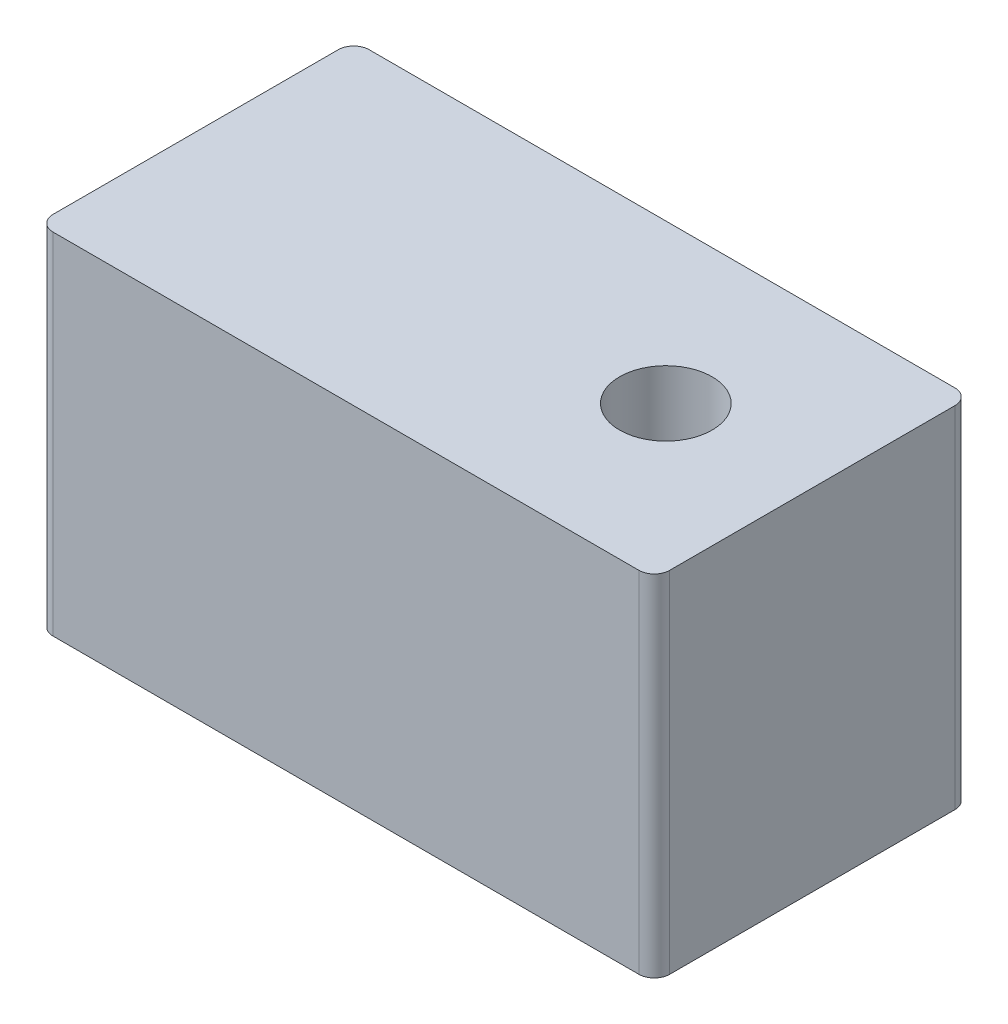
ISO-10303-21;
HEADER;
FILE_DESCRIPTION(('STEP AP214'),'2;1');
FILE_NAME('part.step','',(''),(''),'','','');
FILE_SCHEMA(('AUTOMOTIVE_DESIGN { 1 0 10303 214 1 1 1 1 }'));
ENDSEC;
DATA;
#1=APPLICATION_CONTEXT('core data for automotive mechanical design processes');
#2=APPLICATION_PROTOCOL_DEFINITION('international standard','automotive_design',2000,#1);
#3=PRODUCT_CONTEXT('',#1,'mechanical');
#4=PRODUCT('Part','Part','',(#3));
#5=PRODUCT_RELATED_PRODUCT_CATEGORY('part','',(#4));
#6=PRODUCT_DEFINITION_FORMATION('','',#4);
#7=PRODUCT_DEFINITION_CONTEXT('part definition',#1,'design');
#8=PRODUCT_DEFINITION('design','',#6,#7);
#9=PRODUCT_DEFINITION_SHAPE('','',#8);
#10=(LENGTH_UNIT() NAMED_UNIT(*) SI_UNIT(.MILLI.,.METRE.));
#11=(NAMED_UNIT(*) PLANE_ANGLE_UNIT() SI_UNIT($,.RADIAN.));
#12=(NAMED_UNIT(*) SI_UNIT($,.STERADIAN.) SOLID_ANGLE_UNIT());
#13=UNCERTAINTY_MEASURE_WITH_UNIT(LENGTH_MEASURE(1.E-05),#10,'distance_accuracy_value','');
#14=(GEOMETRIC_REPRESENTATION_CONTEXT(3) GLOBAL_UNCERTAINTY_ASSIGNED_CONTEXT((#13)) GLOBAL_UNIT_ASSIGNED_CONTEXT((#10,
#11,#12)) REPRESENTATION_CONTEXT('',''));
#15=CARTESIAN_POINT('',(0.,0.,0.));
#16=DIRECTION('',(0.,0.,1.));
#17=DIRECTION('',(1.,0.,0.));
#18=AXIS2_PLACEMENT_3D('',#15,#16,#17);
#19=CARTESIAN_POINT('',(19.,22.7,-9.25000000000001));
#20=DIRECTION('',(0.,-1.,0.));
#21=DIRECTION('',(0.,0.,-1.));
#22=AXIS2_PLACEMENT_3D('',#19,#20,#21);
#23=CYLINDRICAL_SURFACE('',#22,1.);
#24=CARTESIAN_POINT('',(19.,0.,-9.25000000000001));
#25=DIRECTION('',(0.,1.,0.));
#26=DIRECTION('',(0.,0.,-1.));
#27=AXIS2_PLACEMENT_3D('',#24,#25,#26);
#28=CIRCLE('',#27,1.);
#29=CARTESIAN_POINT('',(20.,0.,-9.25000000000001));
#30=VERTEX_POINT('',#29);
#31=CARTESIAN_POINT('',(19.,0.,-10.25));
#32=VERTEX_POINT('',#31);
#33=EDGE_CURVE('E129',#30,#32,#28,.T.);
#34=ORIENTED_EDGE('',*,*,#33,.T.);
#35=DIRECTION('',(0.,-1.,0.));
#36=VECTOR('',#35,1.);
#37=CARTESIAN_POINT('',(19.,22.7,-10.25));
#38=LINE('',#37,#36);
#39=CARTESIAN_POINT('',(19.,22.7,-10.25));
#40=VERTEX_POINT('',#39);
#41=EDGE_CURVE('E11',#40,#32,#38,.T.);
#42=ORIENTED_EDGE('',*,*,#41,.F.);
#43=CARTESIAN_POINT('',(19.,22.7,-9.25000000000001));
#44=DIRECTION('',(0.,1.,0.));
#45=DIRECTION('',(0.,0.,-1.));
#46=AXIS2_PLACEMENT_3D('',#43,#44,#45);
#47=CIRCLE('',#46,1.);
#48=CARTESIAN_POINT('',(20.,22.7,-9.25000000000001));
#49=VERTEX_POINT('',#48);
#50=EDGE_CURVE('E144',#49,#40,#47,.T.);
#51=ORIENTED_EDGE('',*,*,#50,.F.);
#52=DIRECTION('',(0.,-1.,0.));
#53=VECTOR('',#52,1.);
#54=CARTESIAN_POINT('',(20.,22.7,-9.25000000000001));
#55=LINE('',#54,#53);
#56=EDGE_CURVE('E125',#49,#30,#55,.T.);
#57=ORIENTED_EDGE('',*,*,#56,.T.);
#58=EDGE_LOOP('',(#34,#42,#51,#57));
#59=FACE_BOUND('',#58,.T.);
#60=ADVANCED_FACE('F33',(#59),#23,.T.);
#61=CARTESIAN_POINT('',(-19.,22.7,-10.25));
#62=DIRECTION('',(0.,0.,1.));
#63=DIRECTION('',(1.,0.,0.));
#64=AXIS2_PLACEMENT_3D('',#61,#62,#63);
#65=PLANE('',#64);
#66=DIRECTION('',(-1.,0.,0.));
#67=VECTOR('',#66,1.);
#68=CARTESIAN_POINT('',(-19.,0.,-10.25));
#69=LINE('',#68,#67);
#70=CARTESIAN_POINT('',(-19.,0.,-10.25));
#71=VERTEX_POINT('',#70);
#72=EDGE_CURVE('E132',#32,#71,#69,.T.);
#73=ORIENTED_EDGE('',*,*,#72,.T.);
#74=DIRECTION('',(0.,-1.,0.));
#75=VECTOR('',#74,1.);
#76=CARTESIAN_POINT('',(-19.,22.7,-10.25));
#77=LINE('',#76,#75);
#78=CARTESIAN_POINT('',(-19.,22.7,-10.25));
#79=VERTEX_POINT('',#78);
#80=EDGE_CURVE('E41',#79,#71,#77,.T.);
#81=ORIENTED_EDGE('',*,*,#80,.F.);
#82=DIRECTION('',(-1.,0.,0.));
#83=VECTOR('',#82,1.);
#84=CARTESIAN_POINT('',(-19.,22.7,-10.25));
#85=LINE('',#84,#83);
#86=EDGE_CURVE('E92',#40,#79,#85,.T.);
#87=ORIENTED_EDGE('',*,*,#86,.F.);
#88=ORIENTED_EDGE('',*,*,#41,.T.);
#89=EDGE_LOOP('',(#73,#81,#87,#88));
#90=FACE_BOUND('',#89,.T.);
#91=ADVANCED_FACE('F201',(#90),#65,.F.);
#92=CARTESIAN_POINT('',(-19.,22.7,-9.25));
#93=DIRECTION('',(0.,-1.,0.));
#94=DIRECTION('',(0.,0.,-1.));
#95=AXIS2_PLACEMENT_3D('',#92,#93,#94);
#96=CYLINDRICAL_SURFACE('',#95,1.);
#97=CARTESIAN_POINT('',(-19.,0.,-9.25));
#98=DIRECTION('',(0.,1.,0.));
#99=DIRECTION('',(0.,0.,1.));
#100=AXIS2_PLACEMENT_3D('',#97,#98,#99);
#101=CIRCLE('',#100,1.);
#102=CARTESIAN_POINT('',(-20.,0.,-9.25));
#103=VERTEX_POINT('',#102);
#104=EDGE_CURVE('E135',#71,#103,#101,.T.);
#105=ORIENTED_EDGE('',*,*,#104,.T.);
#106=DIRECTION('',(0.,-1.,0.));
#107=VECTOR('',#106,1.);
#108=CARTESIAN_POINT('',(-20.,22.7,-9.25));
#109=LINE('',#108,#107);
#110=CARTESIAN_POINT('',(-20.,22.7,-9.25));
#111=VERTEX_POINT('',#110);
#112=EDGE_CURVE('E151',#111,#103,#109,.T.);
#113=ORIENTED_EDGE('',*,*,#112,.F.);
#114=CARTESIAN_POINT('',(-19.,22.7,-9.25));
#115=DIRECTION('',(0.,1.,0.));
#116=DIRECTION('',(0.,0.,1.));
#117=AXIS2_PLACEMENT_3D('',#114,#115,#116);
#118=CIRCLE('',#117,1.);
#119=EDGE_CURVE('E159',#79,#111,#118,.T.);
#120=ORIENTED_EDGE('',*,*,#119,.F.);
#121=ORIENTED_EDGE('',*,*,#80,.T.);
#122=EDGE_LOOP('',(#105,#113,#120,#121));
#123=FACE_BOUND('',#122,.T.);
#124=ADVANCED_FACE('F157',(#123),#96,.T.);
#125=CARTESIAN_POINT('',(-20.,22.7,-9.25));
#126=DIRECTION('',(1.,0.,0.));
#127=DIRECTION('',(0.,0.,-1.));
#128=AXIS2_PLACEMENT_3D('',#125,#126,#127);
#129=PLANE('',#128);
#130=DIRECTION('',(0.,0.,1.));
#131=VECTOR('',#130,1.);
#132=CARTESIAN_POINT('',(-20.,0.,-9.25));
#133=LINE('',#132,#131);
#134=CARTESIAN_POINT('',(-20.,0.,9.25));
#135=VERTEX_POINT('',#134);
#136=EDGE_CURVE('E137',#103,#135,#133,.T.);
#137=ORIENTED_EDGE('',*,*,#136,.T.);
#138=DIRECTION('',(0.,-1.,0.));
#139=VECTOR('',#138,1.);
#140=CARTESIAN_POINT('',(-20.,22.7,9.25));
#141=LINE('',#140,#139);
#142=CARTESIAN_POINT('',(-20.,22.7,9.25));
#143=VERTEX_POINT('',#142);
#144=EDGE_CURVE('E148',#143,#135,#141,.T.);
#145=ORIENTED_EDGE('',*,*,#144,.F.);
#146=DIRECTION('',(0.,0.,1.));
#147=VECTOR('',#146,1.);
#148=CARTESIAN_POINT('',(-20.,22.7,-9.25));
#149=LINE('',#148,#147);
#150=EDGE_CURVE('E171',#111,#143,#149,.T.);
#151=ORIENTED_EDGE('',*,*,#150,.F.);
#152=ORIENTED_EDGE('',*,*,#112,.T.);
#153=EDGE_LOOP('',(#137,#145,#151,#152));
#154=FACE_BOUND('',#153,.T.);
#155=ADVANCED_FACE('F167',(#154),#129,.F.);
#156=CARTESIAN_POINT('',(-19.,22.7,9.25));
#157=DIRECTION('',(0.,-1.,0.));
#158=DIRECTION('',(0.,0.,-1.));
#159=AXIS2_PLACEMENT_3D('',#156,#157,#158);
#160=CYLINDRICAL_SURFACE('',#159,1.);
#161=CARTESIAN_POINT('',(-19.,0.,9.25));
#162=DIRECTION('',(0.,1.,0.));
#163=DIRECTION('',(0.,0.,1.));
#164=AXIS2_PLACEMENT_3D('',#161,#162,#163);
#165=CIRCLE('',#164,1.);
#166=CARTESIAN_POINT('',(-19.,0.,10.25));
#167=VERTEX_POINT('',#166);
#168=EDGE_CURVE('E139',#135,#167,#165,.T.);
#169=ORIENTED_EDGE('',*,*,#168,.T.);
#170=DIRECTION('',(0.,-1.,0.));
#171=VECTOR('',#170,1.);
#172=CARTESIAN_POINT('',(-19.,22.7,10.25));
#173=LINE('',#172,#171);
#174=CARTESIAN_POINT('',(-19.,22.7,10.25));
#175=VERTEX_POINT('',#174);
#176=EDGE_CURVE('E120',#175,#167,#173,.T.);
#177=ORIENTED_EDGE('',*,*,#176,.F.);
#178=CARTESIAN_POINT('',(-19.,22.7,9.25));
#179=DIRECTION('',(0.,1.,0.));
#180=DIRECTION('',(0.,0.,1.));
#181=AXIS2_PLACEMENT_3D('',#178,#179,#180);
#182=CIRCLE('',#181,1.);
#183=EDGE_CURVE('E111',#143,#175,#182,.T.);
#184=ORIENTED_EDGE('',*,*,#183,.F.);
#185=ORIENTED_EDGE('',*,*,#144,.T.);
#186=EDGE_LOOP('',(#169,#177,#184,#185));
#187=FACE_BOUND('',#186,.T.);
#188=ADVANCED_FACE('F170',(#187),#160,.T.);
#189=CARTESIAN_POINT('',(-19.,22.7,10.25));
#190=DIRECTION('',(0.,0.,-1.));
#191=DIRECTION('',(-1.,0.,0.));
#192=AXIS2_PLACEMENT_3D('',#189,#190,#191);
#193=PLANE('',#192);
#194=DIRECTION('',(1.,0.,0.));
#195=VECTOR('',#194,1.);
#196=CARTESIAN_POINT('',(-19.,0.,10.25));
#197=LINE('',#196,#195);
#198=CARTESIAN_POINT('',(19.,0.,10.25));
#199=VERTEX_POINT('',#198);
#200=EDGE_CURVE('E119',#167,#199,#197,.T.);
#201=ORIENTED_EDGE('',*,*,#200,.T.);
#202=DIRECTION('',(0.,-1.,0.));
#203=VECTOR('',#202,1.);
#204=CARTESIAN_POINT('',(19.,22.7,10.25));
#205=LINE('',#204,#203);
#206=CARTESIAN_POINT('',(19.,22.7,10.25));
#207=VERTEX_POINT('',#206);
#208=EDGE_CURVE('E116',#207,#199,#205,.T.);
#209=ORIENTED_EDGE('',*,*,#208,.F.);
#210=DIRECTION('',(1.,0.,0.));
#211=VECTOR('',#210,1.);
#212=CARTESIAN_POINT('',(-19.,22.7,10.25));
#213=LINE('',#212,#211);
#214=EDGE_CURVE('E105',#175,#207,#213,.T.);
#215=ORIENTED_EDGE('',*,*,#214,.F.);
#216=ORIENTED_EDGE('',*,*,#176,.T.);
#217=EDGE_LOOP('',(#201,#209,#215,#216));
#218=FACE_BOUND('',#217,.T.);
#219=ADVANCED_FACE('F117',(#218),#193,.F.);
#220=CARTESIAN_POINT('',(19.,22.7,9.25000000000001));
#221=DIRECTION('',(0.,-1.,0.));
#222=DIRECTION('',(0.,0.,-1.));
#223=AXIS2_PLACEMENT_3D('',#220,#221,#222);
#224=CYLINDRICAL_SURFACE('',#223,1.);
#225=CARTESIAN_POINT('',(19.,0.,9.25000000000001));
#226=DIRECTION('',(0.,1.,0.));
#227=DIRECTION('',(0.,0.,-1.));
#228=AXIS2_PLACEMENT_3D('',#225,#226,#227);
#229=CIRCLE('',#228,1.);
#230=CARTESIAN_POINT('',(20.,0.,9.25000000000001));
#231=VERTEX_POINT('',#230);
#232=EDGE_CURVE('E78',#199,#231,#229,.T.);
#233=ORIENTED_EDGE('',*,*,#232,.T.);
#234=DIRECTION('',(0.,-1.,0.));
#235=VECTOR('',#234,1.);
#236=CARTESIAN_POINT('',(20.,22.7,9.25000000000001));
#237=LINE('',#236,#235);
#238=CARTESIAN_POINT('',(20.,22.7,9.25000000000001));
#239=VERTEX_POINT('',#238);
#240=EDGE_CURVE('E121',#239,#231,#237,.T.);
#241=ORIENTED_EDGE('',*,*,#240,.F.);
#242=CARTESIAN_POINT('',(19.,22.7,9.25000000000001));
#243=DIRECTION('',(0.,1.,0.));
#244=DIRECTION('',(0.,0.,-1.));
#245=AXIS2_PLACEMENT_3D('',#242,#243,#244);
#246=CIRCLE('',#245,1.);
#247=EDGE_CURVE('E109',#207,#239,#246,.T.);
#248=ORIENTED_EDGE('',*,*,#247,.F.);
#249=ORIENTED_EDGE('',*,*,#208,.T.);
#250=EDGE_LOOP('',(#233,#241,#248,#249));
#251=FACE_BOUND('',#250,.T.);
#252=ADVANCED_FACE('F123',(#251),#224,.T.);
#253=CARTESIAN_POINT('',(20.,22.7,-9.25000000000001));
#254=DIRECTION('',(-1.,0.,0.));
#255=DIRECTION('',(0.,0.,1.));
#256=AXIS2_PLACEMENT_3D('',#253,#254,#255);
#257=PLANE('',#256);
#258=DIRECTION('',(0.,0.,-1.));
#259=VECTOR('',#258,1.);
#260=CARTESIAN_POINT('',(20.,0.,-9.25000000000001));
#261=LINE('',#260,#259);
#262=EDGE_CURVE('E84',#231,#30,#261,.T.);
#263=ORIENTED_EDGE('',*,*,#262,.T.);
#264=ORIENTED_EDGE('',*,*,#56,.F.);
#265=DIRECTION('',(0.,0.,-1.));
#266=VECTOR('',#265,1.);
#267=CARTESIAN_POINT('',(20.,22.7,-9.25000000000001));
#268=LINE('',#267,#266);
#269=EDGE_CURVE('E49',#239,#49,#268,.T.);
#270=ORIENTED_EDGE('',*,*,#269,.F.);
#271=ORIENTED_EDGE('',*,*,#240,.T.);
#272=EDGE_LOOP('',(#263,#264,#270,#271));
#273=FACE_BOUND('',#272,.T.);
#274=ADVANCED_FACE('F192',(#273),#257,.F.);
#275=CARTESIAN_POINT('',(19.,22.7,-9.25000000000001));
#276=DIRECTION('',(0.,-1.,0.));
#277=DIRECTION('',(0.,0.,-1.));
#278=AXIS2_PLACEMENT_3D('',#275,#276,#277);
#279=PLANE('',#278);
#280=CARTESIAN_POINT('',(10.5,22.7,0.));
#281=DIRECTION('',(0.,1.,0.));
#282=DIRECTION('',(0.,0.,1.));
#283=AXIS2_PLACEMENT_3D('',#280,#281,#282);
#284=CIRCLE('',#283,3.);
#285=CARTESIAN_POINT('',(10.5,22.7,3.));
#286=VERTEX_POINT('',#285);
#287=EDGE_CURVE('E177',#286,#286,#284,.T.);
#288=ORIENTED_EDGE('',*,*,#287,.F.);
#289=EDGE_LOOP('',(#288));
#290=FACE_BOUND('',#289,.T.);
#291=ORIENTED_EDGE('',*,*,#50,.T.);
#292=ORIENTED_EDGE('',*,*,#86,.T.);
#293=ORIENTED_EDGE('',*,*,#119,.T.);
#294=ORIENTED_EDGE('',*,*,#150,.T.);
#295=ORIENTED_EDGE('',*,*,#183,.T.);
#296=ORIENTED_EDGE('',*,*,#214,.T.);
#297=ORIENTED_EDGE('',*,*,#247,.T.);
#298=ORIENTED_EDGE('',*,*,#269,.T.);
#299=EDGE_LOOP('',(#291,#292,#293,#294,#295,#296,#297,#298));
#300=FACE_BOUND('',#299,.T.);
#301=ADVANCED_FACE('F107',(#290,#300),#279,.F.);
#302=CARTESIAN_POINT('',(19.,0.,-9.25000000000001));
#303=DIRECTION('',(0.,-1.,0.));
#304=DIRECTION('',(0.,0.,-1.));
#305=AXIS2_PLACEMENT_3D('',#302,#303,#304);
#306=PLANE('',#305);
#307=ORIENTED_EDGE('',*,*,#33,.F.);
#308=ORIENTED_EDGE('',*,*,#262,.F.);
#309=ORIENTED_EDGE('',*,*,#232,.F.);
#310=ORIENTED_EDGE('',*,*,#200,.F.);
#311=ORIENTED_EDGE('',*,*,#168,.F.);
#312=ORIENTED_EDGE('',*,*,#136,.F.);
#313=ORIENTED_EDGE('',*,*,#104,.F.);
#314=ORIENTED_EDGE('',*,*,#72,.F.);
#315=EDGE_LOOP('',(#307,#308,#309,#310,#311,#312,#313,#314));
#316=FACE_BOUND('',#315,.T.);
#317=ADVANCED_FACE('F163',(#316),#306,.T.);
#318=CARTESIAN_POINT('',(10.5,12.7,0.));
#319=DIRECTION('',(0.,1.,0.));
#320=DIRECTION('',(0.,0.,1.));
#321=AXIS2_PLACEMENT_3D('',#318,#319,#320);
#322=CYLINDRICAL_SURFACE('',#321,3.);
#323=CARTESIAN_POINT('',(10.5,12.7,0.));
#324=DIRECTION('',(0.,1.,0.));
#325=DIRECTION('',(0.,0.,1.));
#326=AXIS2_PLACEMENT_3D('',#323,#324,#325);
#327=CIRCLE('',#326,3.);
#328=CARTESIAN_POINT('',(10.5,12.7,3.));
#329=VERTEX_POINT('',#328);
#330=EDGE_CURVE('E133',#329,#329,#327,.T.);
#331=ORIENTED_EDGE('',*,*,#330,.F.);
#332=EDGE_LOOP('',(#331));
#333=FACE_BOUND('',#332,.T.);
#334=ORIENTED_EDGE('',*,*,#287,.T.);
#335=EDGE_LOOP('',(#334));
#336=FACE_BOUND('',#335,.T.);
#337=ADVANCED_FACE('F185',(#333,#336),#322,.F.);
#338=CARTESIAN_POINT('',(10.5,12.7,0.));
#339=DIRECTION('',(0.,1.,0.));
#340=DIRECTION('',(0.,0.,1.));
#341=AXIS2_PLACEMENT_3D('',#338,#339,#340);
#342=PLANE('',#341);
#343=ORIENTED_EDGE('',*,*,#330,.T.);
#344=EDGE_LOOP('',(#343));
#345=FACE_BOUND('',#344,.T.);
#346=ADVANCED_FACE('F183',(#345),#342,.T.);
#347=CLOSED_SHELL('',(#60,#91,#124,#155,#188,#219,#252,#274,#301,#317,#337,#346));
#348=MANIFOLD_SOLID_BREP('B2',#347);
#349=ADVANCED_BREP_SHAPE_REPRESENTATION('',(#18,#348),#14);
#350=SHAPE_DEFINITION_REPRESENTATION(#9,#349);
ENDSEC;
END-ISO-10303-21;
